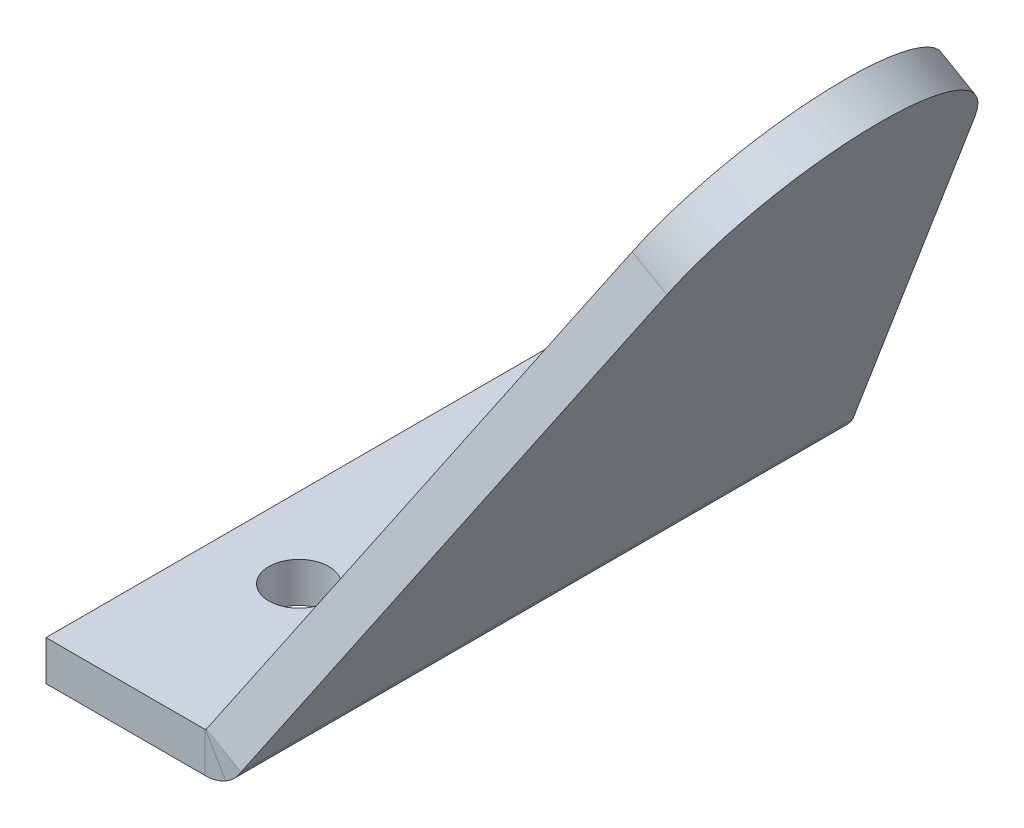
ISO-10303-21;
HEADER;
FILE_DESCRIPTION(('STEP AP214'),'2;1');
FILE_NAME('part.step','',(''),(''),'','','');
FILE_SCHEMA(('AUTOMOTIVE_DESIGN { 1 0 10303 214 1 1 1 1 }'));
ENDSEC;
DATA;
#1=APPLICATION_CONTEXT('core data for automotive mechanical design processes');
#2=APPLICATION_PROTOCOL_DEFINITION('international standard','automotive_design',2000,#1);
#3=PRODUCT_CONTEXT('',#1,'mechanical');
#4=PRODUCT('Part','Part','',(#3));
#5=PRODUCT_RELATED_PRODUCT_CATEGORY('part','',(#4));
#6=PRODUCT_DEFINITION_FORMATION('','',#4);
#7=PRODUCT_DEFINITION_CONTEXT('part definition',#1,'design');
#8=PRODUCT_DEFINITION('design','',#6,#7);
#9=PRODUCT_DEFINITION_SHAPE('','',#8);
#10=(LENGTH_UNIT() NAMED_UNIT(*) SI_UNIT(.MILLI.,.METRE.));
#11=(NAMED_UNIT(*) PLANE_ANGLE_UNIT() SI_UNIT($,.RADIAN.));
#12=(NAMED_UNIT(*) SI_UNIT($,.STERADIAN.) SOLID_ANGLE_UNIT());
#13=UNCERTAINTY_MEASURE_WITH_UNIT(LENGTH_MEASURE(1.E-05),#10,'distance_accuracy_value','');
#14=(GEOMETRIC_REPRESENTATION_CONTEXT(3) GLOBAL_UNCERTAINTY_ASSIGNED_CONTEXT((#13)) GLOBAL_UNIT_ASSIGNED_CONTEXT((#10,
#11,#12)) REPRESENTATION_CONTEXT('',''));
#15=CARTESIAN_POINT('',(0.,0.,0.));
#16=DIRECTION('',(0.,0.,1.));
#17=DIRECTION('',(1.,0.,0.));
#18=AXIS2_PLACEMENT_3D('',#15,#16,#17);
#19=CARTESIAN_POINT('',(12.0080391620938,3.00464141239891,-46.));
#20=DIRECTION('',(-0.133714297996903,-0.231599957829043,0.963577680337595));
#21=DIRECTION('',(0.481788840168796,0.83448274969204,0.267428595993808));
#22=AXIS2_PLACEMENT_3D('',#19,#20,#21);
#23=PLANE('',#22);
#24=DIRECTION('',(-0.481788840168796,-0.83448274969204,-0.267428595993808));
#25=VECTOR('',#24,1.);
#26=CARTESIAN_POINT('',(14.6061153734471,1.50464141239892,-46.));
#27=LINE('',#26,#25);
#28=CARTESIAN_POINT('',(35.2106869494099,37.1928062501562,-34.5629321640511));
#29=VERTEX_POINT('',#28);
#30=CARTESIAN_POINT('',(14.6323031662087,1.55000000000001,-45.9854638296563));
#31=VERTEX_POINT('',#30);
#32=EDGE_CURVE('E88',#29,#31,#27,.T.);
#33=ORIENTED_EDGE('',*,*,#32,.T.);
#34=CARTESIAN_POINT('',(12.0342269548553,3.05,-45.9854638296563));
#35=CARTESIAN_POINT('',(14.6323031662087,1.55000000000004,-45.9854638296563));
#36=B_SPLINE_CURVE_WITH_KNOTS('',1,(#34,#35),.UNSPECIFIED.,.F.,.F.,(2,2),(0.,1.),.UNSPECIFIED.);
#37=CARTESIAN_POINT('',(12.0342269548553,3.05,-45.9854638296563));
#38=VERTEX_POINT('',#37);
#39=EDGE_CURVE('E389',#31,#38,#36,.F.);
#40=ORIENTED_EDGE('',*,*,#39,.T.);
#41=DIRECTION('',(-0.481788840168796,-0.83448274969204,-0.267428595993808));
#42=VECTOR('',#41,1.);
#43=CARTESIAN_POINT('',(12.0080391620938,3.00464141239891,-46.));
#44=LINE('',#43,#42);
#45=CARTESIAN_POINT('',(32.6126107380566,38.6928062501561,-34.5629321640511));
#46=VERTEX_POINT('',#45);
#47=EDGE_CURVE('E400',#46,#38,#44,.T.);
#48=ORIENTED_EDGE('',*,*,#47,.F.);
#49=DIRECTION('',(0.86602540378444,-0.499999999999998,0.));
#50=VECTOR('',#49,1.);
#51=CARTESIAN_POINT('',(32.6126107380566,38.6928062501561,-34.5629321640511));
#52=LINE('',#51,#50);
#53=EDGE_CURVE('E403',#46,#29,#52,.T.);
#54=ORIENTED_EDGE('',*,*,#53,.T.);
#55=EDGE_LOOP('',(#33,#40,#48,#54));
#56=FACE_BOUND('',#55,.T.);
#57=ADVANCED_FACE('F62',(#56),#23,.F.);
#58=CARTESIAN_POINT('',(12.0080391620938,3.00464141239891,0.));
#59=DIRECTION('',(-0.133714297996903,-0.231599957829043,-0.963577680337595));
#60=DIRECTION('',(-0.481788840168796,-0.83448274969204,0.267428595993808));
#61=AXIS2_PLACEMENT_3D('',#58,#59,#60);
#62=PLANE('',#61);
#63=DIRECTION('',(0.481788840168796,0.83448274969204,-0.267428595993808));
#64=VECTOR('',#63,1.);
#65=CARTESIAN_POINT('',(12.0080391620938,3.00464141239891,0.));
#66=LINE('',#65,#64);
#67=CARTESIAN_POINT('',(12.0342269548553,3.05,-0.0145361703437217));
#68=VERTEX_POINT('',#67);
#69=CARTESIAN_POINT('',(32.6126107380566,38.6928062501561,-11.4370678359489));
#70=VERTEX_POINT('',#69);
#71=EDGE_CURVE('E370',#68,#70,#66,.T.);
#72=ORIENTED_EDGE('',*,*,#71,.F.);
#73=CARTESIAN_POINT('',(14.6323031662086,1.54999999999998,-0.0145361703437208));
#74=CARTESIAN_POINT('',(12.0342269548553,3.05,-0.0145361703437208));
#75=B_SPLINE_CURVE_WITH_KNOTS('',1,(#73,#74),.UNSPECIFIED.,.F.,.F.,(2,2),(0.,1.),.UNSPECIFIED.);
#76=CARTESIAN_POINT('',(14.6323031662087,1.55000000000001,-0.0145361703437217));
#77=VERTEX_POINT('',#76);
#78=EDGE_CURVE('E14',#68,#77,#75,.F.);
#79=ORIENTED_EDGE('',*,*,#78,.T.);
#80=DIRECTION('',(0.481788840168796,0.83448274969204,-0.267428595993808));
#81=VECTOR('',#80,1.);
#82=CARTESIAN_POINT('',(14.6061153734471,1.50464141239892,0.));
#83=LINE('',#82,#81);
#84=CARTESIAN_POINT('',(35.2106869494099,37.1928062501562,-11.4370678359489));
#85=VERTEX_POINT('',#84);
#86=EDGE_CURVE('E81',#77,#85,#83,.T.);
#87=ORIENTED_EDGE('',*,*,#86,.T.);
#88=DIRECTION('',(0.86602540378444,-0.499999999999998,0.));
#89=VECTOR('',#88,1.);
#90=CARTESIAN_POINT('',(32.6126107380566,38.6928062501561,-11.4370678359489));
#91=LINE('',#90,#89);
#92=EDGE_CURVE('E373',#70,#85,#91,.T.);
#93=ORIENTED_EDGE('',*,*,#92,.F.);
#94=EDGE_LOOP('',(#72,#79,#87,#93));
#95=FACE_BOUND('',#94,.T.);
#96=ADVANCED_FACE('F64',(#95),#62,.F.);
#97=CARTESIAN_POINT('',(33.606115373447,34.4136067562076,-23.));
#98=DIRECTION('',(-0.86602540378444,0.499999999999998,0.));
#99=DIRECTION('',(0.,0.,1.));
#100=AXIS2_PLACEMENT_3D('',#97,#98,#99);
#101=PLANE('',#100);
#102=ORIENTED_EDGE('',*,*,#86,.F.);
#103=DIRECTION('',(0.,0.,-1.));
#104=VECTOR('',#103,1.);
#105=CARTESIAN_POINT('',(14.6323031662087,1.55000000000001,-23.));
#106=LINE('',#105,#104);
#107=EDGE_CURVE('E74',#77,#31,#106,.T.);
#108=ORIENTED_EDGE('',*,*,#107,.T.);
#109=ORIENTED_EDGE('',*,*,#32,.F.);
#110=CARTESIAN_POINT('',(33.606115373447,34.4136067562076,-23.));
#111=DIRECTION('',(-0.86602540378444,0.499999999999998,0.));
#112=DIRECTION('',(0.,0.,1.));
#113=AXIS2_PLACEMENT_3D('',#110,#111,#112);
#114=CIRCLE('',#113,12.);
#115=EDGE_CURVE('E401',#85,#29,#114,.T.);
#116=ORIENTED_EDGE('',*,*,#115,.F.);
#117=EDGE_LOOP('',(#102,#108,#109,#116));
#118=FACE_BOUND('',#117,.T.);
#119=ADVANCED_FACE('F357',(#118),#101,.F.);
#120=CARTESIAN_POINT('',(31.0080391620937,35.9136067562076,-23.));
#121=DIRECTION('',(-0.86602540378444,0.499999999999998,0.));
#122=DIRECTION('',(0.,0.,1.));
#123=AXIS2_PLACEMENT_3D('',#120,#121,#122);
#124=PLANE('',#123);
#125=DIRECTION('',(0.,0.,-1.));
#126=VECTOR('',#125,1.);
#127=CARTESIAN_POINT('',(12.0342269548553,3.05,-23.));
#128=LINE('',#127,#126);
#129=EDGE_CURVE('E378',#68,#38,#128,.T.);
#130=ORIENTED_EDGE('',*,*,#129,.F.);
#131=ORIENTED_EDGE('',*,*,#71,.T.);
#132=CARTESIAN_POINT('',(31.0080391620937,35.9136067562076,-23.));
#133=DIRECTION('',(-0.86602540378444,0.499999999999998,0.));
#134=DIRECTION('',(0.,0.,1.));
#135=AXIS2_PLACEMENT_3D('',#132,#133,#134);
#136=CIRCLE('',#135,12.);
#137=EDGE_CURVE('E375',#70,#46,#136,.T.);
#138=ORIENTED_EDGE('',*,*,#137,.T.);
#139=ORIENTED_EDGE('',*,*,#47,.T.);
#140=EDGE_LOOP('',(#130,#131,#138,#139));
#141=FACE_BOUND('',#140,.T.);
#142=ADVANCED_FACE('F354',(#141),#124,.T.);
#143=CARTESIAN_POINT('',(31.0080391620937,35.9136067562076,-23.));
#144=DIRECTION('',(0.86602540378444,-0.499999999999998,0.));
#145=DIRECTION('',(0.,0.,-1.));
#146=AXIS2_PLACEMENT_3D('',#143,#144,#145);
#147=CYLINDRICAL_SURFACE('',#146,12.);
#148=ORIENTED_EDGE('',*,*,#115,.T.);
#149=ORIENTED_EDGE('',*,*,#53,.F.);
#150=ORIENTED_EDGE('',*,*,#137,.F.);
#151=ORIENTED_EDGE('',*,*,#92,.T.);
#152=EDGE_LOOP('',(#148,#149,#150,#151));
#153=FACE_BOUND('',#152,.T.);
#154=ADVANCED_FACE('F330',(#153),#147,.T.);
#155=CARTESIAN_POINT('',(0.,3.,0.));
#156=DIRECTION('',(1.,0.,0.));
#157=DIRECTION('',(0.,0.,-1.));
#158=AXIS2_PLACEMENT_3D('',#155,#156,#157);
#159=PLANE('',#158);
#160=DIRECTION('',(0.,0.,1.));
#161=VECTOR('',#160,1.);
#162=CARTESIAN_POINT('',(0.,0.,0.));
#163=LINE('',#162,#161);
#164=CARTESIAN_POINT('',(0.,0.,-46.));
#165=VERTEX_POINT('',#164);
#166=CARTESIAN_POINT('',(0.,0.,0.));
#167=VERTEX_POINT('',#166);
#168=EDGE_CURVE('E173',#165,#167,#163,.T.);
#169=ORIENTED_EDGE('',*,*,#168,.T.);
#170=DIRECTION('',(0.,-1.,0.));
#171=VECTOR('',#170,1.);
#172=CARTESIAN_POINT('',(0.,3.,0.));
#173=LINE('',#172,#171);
#174=CARTESIAN_POINT('',(0.,3.,0.));
#175=VERTEX_POINT('',#174);
#176=EDGE_CURVE('E435',#175,#167,#173,.T.);
#177=ORIENTED_EDGE('',*,*,#176,.F.);
#178=DIRECTION('',(0.,0.,1.));
#179=VECTOR('',#178,1.);
#180=CARTESIAN_POINT('',(0.,3.,0.));
#181=LINE('',#180,#179);
#182=CARTESIAN_POINT('',(0.,3.,-46.));
#183=VERTEX_POINT('',#182);
#184=EDGE_CURVE('E154',#183,#175,#181,.T.);
#185=ORIENTED_EDGE('',*,*,#184,.F.);
#186=DIRECTION('',(0.,-1.,0.));
#187=VECTOR('',#186,1.);
#188=CARTESIAN_POINT('',(0.,3.,-46.));
#189=LINE('',#188,#187);
#190=EDGE_CURVE('E150',#183,#165,#189,.T.);
#191=ORIENTED_EDGE('',*,*,#190,.T.);
#192=EDGE_LOOP('',(#169,#177,#185,#191));
#193=FACE_BOUND('',#192,.T.);
#194=ADVANCED_FACE('F326',(#193),#159,.F.);
#195=CARTESIAN_POINT('',(6.,3.,-13.));
#196=DIRECTION('',(0.,-1.,0.));
#197=DIRECTION('',(0.,0.,-1.));
#198=AXIS2_PLACEMENT_3D('',#195,#196,#197);
#199=CYLINDRICAL_SURFACE('',#198,2.25);
#200=CARTESIAN_POINT('',(6.,3.,-13.));
#201=DIRECTION('',(0.,1.,0.));
#202=DIRECTION('',(0.,0.,1.));
#203=AXIS2_PLACEMENT_3D('',#200,#201,#202);
#204=CIRCLE('',#203,2.25);
#205=CARTESIAN_POINT('',(6.,3.,-10.75));
#206=VERTEX_POINT('',#205);
#207=EDGE_CURVE('E452',#206,#206,#204,.T.);
#208=ORIENTED_EDGE('',*,*,#207,.T.);
#209=EDGE_LOOP('',(#208));
#210=FACE_BOUND('',#209,.T.);
#211=CARTESIAN_POINT('',(6.,0.,-13.));
#212=DIRECTION('',(0.,1.,0.));
#213=DIRECTION('',(0.,0.,1.));
#214=AXIS2_PLACEMENT_3D('',#211,#212,#213);
#215=CIRCLE('',#214,2.25);
#216=CARTESIAN_POINT('',(6.,0.,-10.75));
#217=VERTEX_POINT('',#216);
#218=EDGE_CURVE('E438',#217,#217,#215,.T.);
#219=ORIENTED_EDGE('',*,*,#218,.F.);
#220=EDGE_LOOP('',(#219));
#221=FACE_BOUND('',#220,.T.);
#222=ADVANCED_FACE('F329',(#210,#221),#199,.F.);
#223=CARTESIAN_POINT('',(6.,3.,-33.));
#224=DIRECTION('',(0.,-1.,0.));
#225=DIRECTION('',(0.,0.,-1.));
#226=AXIS2_PLACEMENT_3D('',#223,#224,#225);
#227=CYLINDRICAL_SURFACE('',#226,2.25);
#228=CARTESIAN_POINT('',(6.,3.,-33.));
#229=DIRECTION('',(0.,1.,0.));
#230=DIRECTION('',(0.,0.,1.));
#231=AXIS2_PLACEMENT_3D('',#228,#229,#230);
#232=CIRCLE('',#231,2.25);
#233=CARTESIAN_POINT('',(6.,3.,-30.75));
#234=VERTEX_POINT('',#233);
#235=EDGE_CURVE('E449',#234,#234,#232,.T.);
#236=ORIENTED_EDGE('',*,*,#235,.T.);
#237=EDGE_LOOP('',(#236));
#238=FACE_BOUND('',#237,.T.);
#239=CARTESIAN_POINT('',(6.,0.,-33.));
#240=DIRECTION('',(0.,1.,0.));
#241=DIRECTION('',(0.,0.,1.));
#242=AXIS2_PLACEMENT_3D('',#239,#240,#241);
#243=CIRCLE('',#242,2.25);
#244=CARTESIAN_POINT('',(6.,0.,-30.75));
#245=VERTEX_POINT('',#244);
#246=EDGE_CURVE('E440',#245,#245,#243,.T.);
#247=ORIENTED_EDGE('',*,*,#246,.F.);
#248=EDGE_LOOP('',(#247));
#249=FACE_BOUND('',#248,.T.);
#250=ADVANCED_FACE('F334',(#238,#249),#227,.F.);
#251=CARTESIAN_POINT('',(50.,3.,-23.));
#252=DIRECTION('',(0.,1.,0.));
#253=DIRECTION('',(0.,0.,1.));
#254=AXIS2_PLACEMENT_3D('',#251,#252,#253);
#255=PLANE('',#254);
#256=ORIENTED_EDGE('',*,*,#235,.F.);
#257=EDGE_LOOP('',(#256));
#258=FACE_BOUND('',#257,.T.);
#259=ORIENTED_EDGE('',*,*,#207,.F.);
#260=EDGE_LOOP('',(#259));
#261=FACE_BOUND('',#260,.T.);
#262=DIRECTION('',(1.,0.,0.));
#263=VECTOR('',#262,1.);
#264=CARTESIAN_POINT('',(0.,3.,0.));
#265=LINE('',#264,#263);
#266=CARTESIAN_POINT('',(11.9476244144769,3.,0.));
#267=VERTEX_POINT('',#266);
#268=EDGE_CURVE('E159',#175,#267,#265,.T.);
#269=ORIENTED_EDGE('',*,*,#268,.T.);
#270=DIRECTION('',(0.,0.,-1.));
#271=VECTOR('',#270,1.);
#272=CARTESIAN_POINT('',(11.9476244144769,3.,-23.));
#273=LINE('',#272,#271);
#274=CARTESIAN_POINT('',(11.9476244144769,3.,-46.));
#275=VERTEX_POINT('',#274);
#276=EDGE_CURVE('E155',#267,#275,#273,.T.);
#277=ORIENTED_EDGE('',*,*,#276,.T.);
#278=DIRECTION('',(-1.,0.,0.));
#279=VECTOR('',#278,1.);
#280=CARTESIAN_POINT('',(0.,3.,-46.));
#281=LINE('',#280,#279);
#282=EDGE_CURVE('E143',#275,#183,#281,.T.);
#283=ORIENTED_EDGE('',*,*,#282,.T.);
#284=ORIENTED_EDGE('',*,*,#184,.T.);
#285=EDGE_LOOP('',(#269,#277,#283,#284));
#286=FACE_BOUND('',#285,.T.);
#287=ADVANCED_FACE('F158',(#258,#261,#286),#255,.T.);
#288=CARTESIAN_POINT('',(0.,3.,-46.));
#289=DIRECTION('',(0.,0.,1.));
#290=DIRECTION('',(1.,0.,0.));
#291=AXIS2_PLACEMENT_3D('',#288,#289,#290);
#292=PLANE('',#291);
#293=DIRECTION('',(0.,1.,0.));
#294=VECTOR('',#293,1.);
#295=CARTESIAN_POINT('',(11.9476244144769,3.,-46.));
#296=LINE('',#295,#294);
#297=CARTESIAN_POINT('',(11.9476244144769,0.,-46.));
#298=VERTEX_POINT('',#297);
#299=EDGE_CURVE('E147',#298,#275,#296,.T.);
#300=ORIENTED_EDGE('',*,*,#299,.F.);
#301=DIRECTION('',(-1.,0.,0.));
#302=VECTOR('',#301,1.);
#303=CARTESIAN_POINT('',(0.,0.,-46.));
#304=LINE('',#303,#302);
#305=EDGE_CURVE('E445',#298,#165,#304,.T.);
#306=ORIENTED_EDGE('',*,*,#305,.T.);
#307=ORIENTED_EDGE('',*,*,#190,.F.);
#308=ORIENTED_EDGE('',*,*,#282,.F.);
#309=EDGE_LOOP('',(#300,#306,#307,#308));
#310=FACE_BOUND('',#309,.T.);
#311=ADVANCED_FACE('F145',(#310),#292,.F.);
#312=CARTESIAN_POINT('',(50.,0.,-23.));
#313=DIRECTION('',(0.,1.,0.));
#314=DIRECTION('',(0.,0.,1.));
#315=AXIS2_PLACEMENT_3D('',#312,#313,#314);
#316=PLANE('',#315);
#317=DIRECTION('',(0.,0.,-1.));
#318=VECTOR('',#317,1.);
#319=CARTESIAN_POINT('',(11.9476244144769,0.,-23.));
#320=LINE('',#319,#318);
#321=CARTESIAN_POINT('',(11.9476244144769,0.,0.));
#322=VERTEX_POINT('',#321);
#323=EDGE_CURVE('E174',#322,#298,#320,.T.);
#324=ORIENTED_EDGE('',*,*,#323,.F.);
#325=DIRECTION('',(1.,0.,0.));
#326=VECTOR('',#325,1.);
#327=CARTESIAN_POINT('',(0.,0.,0.));
#328=LINE('',#327,#326);
#329=EDGE_CURVE('E316',#167,#322,#328,.T.);
#330=ORIENTED_EDGE('',*,*,#329,.F.);
#331=ORIENTED_EDGE('',*,*,#168,.F.);
#332=ORIENTED_EDGE('',*,*,#305,.F.);
#333=EDGE_LOOP('',(#324,#330,#331,#332));
#334=FACE_BOUND('',#333,.T.);
#335=ORIENTED_EDGE('',*,*,#246,.T.);
#336=EDGE_LOOP('',(#335));
#337=FACE_BOUND('',#336,.T.);
#338=ORIENTED_EDGE('',*,*,#218,.T.);
#339=EDGE_LOOP('',(#338));
#340=FACE_BOUND('',#339,.T.);
#341=ADVANCED_FACE('F344',(#334,#337,#340),#316,.F.);
#342=CARTESIAN_POINT('',(0.,3.,0.));
#343=DIRECTION('',(0.,0.,-1.));
#344=DIRECTION('',(-1.,0.,0.));
#345=AXIS2_PLACEMENT_3D('',#342,#343,#344);
#346=PLANE('',#345);
#347=DIRECTION('',(0.,-1.,0.));
#348=VECTOR('',#347,1.);
#349=CARTESIAN_POINT('',(11.9476244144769,3.,0.));
#350=LINE('',#349,#348);
#351=EDGE_CURVE('E394',#267,#322,#350,.T.);
#352=ORIENTED_EDGE('',*,*,#351,.F.);
#353=ORIENTED_EDGE('',*,*,#268,.F.);
#354=ORIENTED_EDGE('',*,*,#176,.T.);
#355=ORIENTED_EDGE('',*,*,#329,.T.);
#356=EDGE_LOOP('',(#352,#353,#354,#355));
#357=FACE_BOUND('',#356,.T.);
#358=ADVANCED_FACE('F347',(#357),#346,.F.);
#359=CARTESIAN_POINT('',(11.9476244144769,3.1,0.));
#360=DIRECTION('',(0.,0.,-1.));
#361=DIRECTION('',(-1.,0.,0.));
#362=AXIS2_PLACEMENT_3D('',#359,#360,#361);
#363=PLANE('',#362);
#364=ORIENTED_EDGE('',*,*,#351,.T.);
#365=CARTESIAN_POINT('',(11.9476244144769,3.1,0.));
#366=DIRECTION('',(0.,0.,-1.));
#367=DIRECTION('',(-1.,0.,0.));
#368=AXIS2_PLACEMENT_3D('',#365,#366,#367);
#369=CIRCLE('',#368,3.1);
#370=CARTESIAN_POINT('',(13.4976244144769,0.415321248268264,0.));
#371=VERTEX_POINT('',#370);
#372=EDGE_CURVE('E226',#322,#371,#369,.F.);
#373=ORIENTED_EDGE('',*,*,#372,.T.);
#374=CARTESIAN_POINT('',(11.9976244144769,3.01339745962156,0.));
#375=CARTESIAN_POINT('',(13.4976244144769,0.415321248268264,0.));
#376=B_SPLINE_CURVE_WITH_KNOTS('',1,(#374,#375),.UNSPECIFIED.,.F.,.F.,(2,2),(0.,1.),.UNSPECIFIED.);
#377=CARTESIAN_POINT('',(11.9976244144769,3.01339745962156,0.));
#378=VERTEX_POINT('',#377);
#379=EDGE_CURVE('E184',#371,#378,#376,.F.);
#380=ORIENTED_EDGE('',*,*,#379,.T.);
#381=CARTESIAN_POINT('',(11.9476244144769,3.1,0.));
#382=DIRECTION('',(0.,0.,1.));
#383=DIRECTION('',(1.,0.,0.));
#384=AXIS2_PLACEMENT_3D('',#381,#382,#383);
#385=CIRCLE('',#384,0.1);
#386=EDGE_CURVE('E379',#267,#378,#385,.T.);
#387=ORIENTED_EDGE('',*,*,#386,.F.);
#388=EDGE_LOOP('',(#364,#373,#380,#387));
#389=FACE_BOUND('',#388,.T.);
#390=ADVANCED_FACE('F258',(#389),#363,.F.);
#391=CARTESIAN_POINT('',(13.4976244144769,0.415321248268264,0.));
#392=CARTESIAN_POINT('',(13.9669477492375,0.68628520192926,-0.00482909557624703));
#393=CARTESIAN_POINT('',(14.3613392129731,1.08067666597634,-0.00965879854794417));
#394=CARTESIAN_POINT('',(14.6323031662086,1.54999999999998,-0.0145361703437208));
#395=CARTESIAN_POINT('',(11.9976244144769,3.01339745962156,0.));
#396=CARTESIAN_POINT('',(12.0127626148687,3.02213750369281,-0.00482869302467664));
#397=CARTESIAN_POINT('',(12.0254869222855,3.03486181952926,-0.00965921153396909));
#398=CARTESIAN_POINT('',(12.0342269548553,3.05,-0.0145361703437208));
#399=B_SPLINE_SURFACE_WITH_KNOTS('',1,3,((#391,#392,#393,#394),(#395,#396,#397,#398)),
.UNSPECIFIED.,.F.,.F.,.F.,(2,2),(4,4),(0.,1.),(0.,1.),.UNSPECIFIED.);
#400=CARTESIAN_POINT('',(13.4976244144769,0.415321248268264,0.));
#401=CARTESIAN_POINT('',(13.9669477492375,0.68628520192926,-0.00482909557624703));
#402=CARTESIAN_POINT('',(14.3613392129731,1.08067666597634,-0.00965879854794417));
#403=CARTESIAN_POINT('',(14.6323031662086,1.54999999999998,-0.0145361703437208));
#404=B_SPLINE_CURVE_WITH_KNOTS('',3,(#400,#401,#402,#403),.UNSPECIFIED.,.F.,.F.,(4,4),(0.,1.),.UNSPECIFIED.);
#405=EDGE_CURVE('E234',#371,#77,#404,.T.);
#406=CARTESIAN_POINT('',(12.0342269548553,3.05,-0.0145361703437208));
#407=CARTESIAN_POINT('',(12.0254869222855,3.03486181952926,-0.00965921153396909));
#408=CARTESIAN_POINT('',(12.0127626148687,3.02213750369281,-0.00482869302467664));
#409=CARTESIAN_POINT('',(11.9976244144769,3.01339745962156,0.));
#410=B_SPLINE_CURVE_WITH_KNOTS('',3,(#406,#407,#408,#409),.UNSPECIFIED.,.F.,.F.,(4,4),(0.,1.),.UNSPECIFIED.);
#411=EDGE_CURVE('E186',#378,#68,#410,.F.);
#412=ORIENTED_EDGE('',*,*,#379,.F.);
#413=ORIENTED_EDGE('',*,*,#405,.T.);
#414=ORIENTED_EDGE('',*,*,#78,.F.);
#415=ORIENTED_EDGE('',*,*,#411,.F.);
#416=EDGE_LOOP('',(#412,#413,#414,#415));
#417=FACE_BOUND('',#416,.T.);
#418=ADVANCED_FACE('F247',(#417),#399,.F.);
#419=CARTESIAN_POINT('',(14.6323031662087,1.55000000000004,-45.9854638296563));
#420=CARTESIAN_POINT('',(14.3613392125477,1.08067666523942,-45.9902929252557));
#421=CARTESIAN_POINT('',(13.9669477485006,0.686285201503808,-45.9951226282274));
#422=CARTESIAN_POINT('',(13.4976244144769,0.415321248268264,-46.));
#423=CARTESIAN_POINT('',(12.0342269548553,3.05,-45.9854638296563));
#424=CARTESIAN_POINT('',(12.0254869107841,3.0348617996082,-45.9902925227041));
#425=CARTESIAN_POINT('',(12.0127625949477,3.02213749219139,-45.9951230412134));
#426=CARTESIAN_POINT('',(11.9976244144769,3.01339745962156,-46.));
#427=B_SPLINE_SURFACE_WITH_KNOTS('',1,3,((#419,#420,#421,#422),(#423,#424,#425,#426)),
.UNSPECIFIED.,.F.,.F.,.F.,(2,2),(4,4),(0.,1.),(0.,1.),.UNSPECIFIED.);
#428=CARTESIAN_POINT('',(14.6323031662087,1.55000000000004,-45.9854638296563));
#429=CARTESIAN_POINT('',(14.3613392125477,1.08067666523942,-45.9902929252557));
#430=CARTESIAN_POINT('',(13.9669477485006,0.686285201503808,-45.9951226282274));
#431=CARTESIAN_POINT('',(13.4976244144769,0.415321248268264,-46.));
#432=B_SPLINE_CURVE_WITH_KNOTS('',3,(#428,#429,#430,#431),.UNSPECIFIED.,.F.,.F.,(4,4),(0.,1.),.UNSPECIFIED.);
#433=CARTESIAN_POINT('',(13.4976244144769,0.415321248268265,-46.));
#434=VERTEX_POINT('',#433);
#435=EDGE_CURVE('E196',#31,#434,#432,.T.);
#436=CARTESIAN_POINT('',(13.4976244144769,0.415321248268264,-46.));
#437=CARTESIAN_POINT('',(11.9976244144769,3.01339745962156,-46.));
#438=B_SPLINE_CURVE_WITH_KNOTS('',1,(#436,#437),.UNSPECIFIED.,.F.,.F.,(2,2),(0.,1.),.UNSPECIFIED.);
#439=CARTESIAN_POINT('',(11.9976244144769,3.01339745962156,-46.));
#440=VERTEX_POINT('',#439);
#441=EDGE_CURVE('E182',#434,#440,#438,.T.);
#442=CARTESIAN_POINT('',(11.9976244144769,3.01339745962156,-46.));
#443=CARTESIAN_POINT('',(12.0127625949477,3.02213749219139,-45.9951230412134));
#444=CARTESIAN_POINT('',(12.0254869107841,3.0348617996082,-45.9902925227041));
#445=CARTESIAN_POINT('',(12.0342269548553,3.05,-45.9854638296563));
#446=B_SPLINE_CURVE_WITH_KNOTS('',3,(#442,#443,#444,#445),.UNSPECIFIED.,.F.,.F.,(4,4),(0.,1.),.UNSPECIFIED.);
#447=EDGE_CURVE('E180',#38,#440,#446,.F.);
#448=ORIENTED_EDGE('',*,*,#39,.F.);
#449=ORIENTED_EDGE('',*,*,#435,.T.);
#450=ORIENTED_EDGE('',*,*,#441,.T.);
#451=ORIENTED_EDGE('',*,*,#447,.F.);
#452=EDGE_LOOP('',(#448,#449,#450,#451));
#453=FACE_BOUND('',#452,.T.);
#454=ADVANCED_FACE('F213',(#453),#427,.F.);
#455=CARTESIAN_POINT('',(11.9476244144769,3.1,-46.));
#456=DIRECTION('',(0.,0.,1.));
#457=DIRECTION('',(1.,0.,0.));
#458=AXIS2_PLACEMENT_3D('',#455,#456,#457);
#459=PLANE('',#458);
#460=CARTESIAN_POINT('',(11.9476244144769,3.1,-46.));
#461=DIRECTION('',(0.,0.,-1.));
#462=DIRECTION('',(-1.,0.,0.));
#463=AXIS2_PLACEMENT_3D('',#460,#461,#462);
#464=CIRCLE('',#463,3.1);
#465=EDGE_CURVE('E172',#434,#298,#464,.T.);
#466=ORIENTED_EDGE('',*,*,#465,.T.);
#467=ORIENTED_EDGE('',*,*,#299,.T.);
#468=CARTESIAN_POINT('',(11.9476244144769,3.1,-46.));
#469=DIRECTION('',(0.,0.,-1.));
#470=DIRECTION('',(-1.,0.,0.));
#471=AXIS2_PLACEMENT_3D('',#468,#469,#470);
#472=CIRCLE('',#471,0.1);
#473=EDGE_CURVE('E170',#440,#275,#472,.T.);
#474=ORIENTED_EDGE('',*,*,#473,.F.);
#475=ORIENTED_EDGE('',*,*,#441,.F.);
#476=EDGE_LOOP('',(#466,#467,#474,#475));
#477=FACE_BOUND('',#476,.T.);
#478=ADVANCED_FACE('F169',(#477),#459,.F.);
#479=CARTESIAN_POINT('',(11.9476244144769,3.1,23.0978413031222));
#480=DIRECTION('',(0.,0.,-1.));
#481=DIRECTION('',(-1.,0.,0.));
#482=AXIS2_PLACEMENT_3D('',#479,#480,#481);
#483=CYLINDRICAL_SURFACE('',#482,0.1);
#484=ORIENTED_EDGE('',*,*,#447,.T.);
#485=ORIENTED_EDGE('',*,*,#473,.T.);
#486=ORIENTED_EDGE('',*,*,#276,.F.);
#487=ORIENTED_EDGE('',*,*,#386,.T.);
#488=ORIENTED_EDGE('',*,*,#411,.T.);
#489=ORIENTED_EDGE('',*,*,#129,.T.);
#490=EDGE_LOOP('',(#484,#485,#486,#487,#488,#489));
#491=FACE_BOUND('',#490,.T.);
#492=ADVANCED_FACE('F177',(#491),#483,.F.);
#493=CARTESIAN_POINT('',(11.9476244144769,3.1,23.0978413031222));
#494=DIRECTION('',(0.,0.,-1.));
#495=DIRECTION('',(-1.,0.,0.));
#496=AXIS2_PLACEMENT_3D('',#493,#494,#495);
#497=CYLINDRICAL_SURFACE('',#496,3.1);
#498=ORIENTED_EDGE('',*,*,#435,.F.);
#499=ORIENTED_EDGE('',*,*,#107,.F.);
#500=ORIENTED_EDGE('',*,*,#405,.F.);
#501=ORIENTED_EDGE('',*,*,#372,.F.);
#502=ORIENTED_EDGE('',*,*,#323,.T.);
#503=ORIENTED_EDGE('',*,*,#465,.F.);
#504=EDGE_LOOP('',(#498,#499,#500,#501,#502,#503));
#505=FACE_BOUND('',#504,.T.);
#506=ADVANCED_FACE('F202',(#505),#497,.T.);
#507=CLOSED_SHELL('',(#57,#96,#119,#142,#154,#194,#222,#250,#287,#311,#341,#358,#390,#418,#454,
#478,#492,#506));
#508=MANIFOLD_SOLID_BREP('B2',#507);
#509=ADVANCED_BREP_SHAPE_REPRESENTATION('',(#18,#508),#14);
#510=SHAPE_DEFINITION_REPRESENTATION(#9,#509);
ENDSEC;
END-ISO-10303-21;
